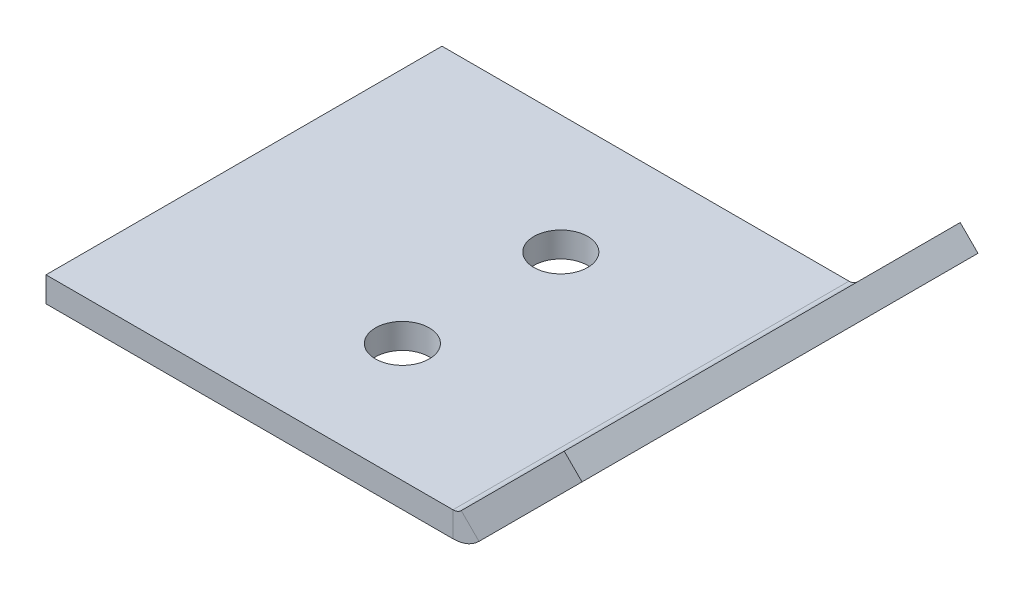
ISO-10303-21;
HEADER;
FILE_DESCRIPTION(('STEP AP214'),'2;1');
FILE_NAME('part.step','',(''),(''),'','','');
FILE_SCHEMA(('AUTOMOTIVE_DESIGN { 1 0 10303 214 1 1 1 1 }'));
ENDSEC;
DATA;
#1=APPLICATION_CONTEXT('core data for automotive mechanical design processes');
#2=APPLICATION_PROTOCOL_DEFINITION('international standard','automotive_design',2000,#1);
#3=PRODUCT_CONTEXT('',#1,'mechanical');
#4=PRODUCT('Part','Part','',(#3));
#5=PRODUCT_RELATED_PRODUCT_CATEGORY('part','',(#4));
#6=PRODUCT_DEFINITION_FORMATION('','',#4);
#7=PRODUCT_DEFINITION_CONTEXT('part definition',#1,'design');
#8=PRODUCT_DEFINITION('design','',#6,#7);
#9=PRODUCT_DEFINITION_SHAPE('','',#8);
#10=(LENGTH_UNIT() NAMED_UNIT(*) SI_UNIT(.MILLI.,.METRE.));
#11=(NAMED_UNIT(*) PLANE_ANGLE_UNIT() SI_UNIT($,.RADIAN.));
#12=(NAMED_UNIT(*) SI_UNIT($,.STERADIAN.) SOLID_ANGLE_UNIT());
#13=UNCERTAINTY_MEASURE_WITH_UNIT(LENGTH_MEASURE(1.E-05),#10,'distance_accuracy_value','');
#14=(GEOMETRIC_REPRESENTATION_CONTEXT(3) GLOBAL_UNCERTAINTY_ASSIGNED_CONTEXT((#13)) GLOBAL_UNIT_ASSIGNED_CONTEXT((#10,
#11,#12)) REPRESENTATION_CONTEXT('',''));
#15=CARTESIAN_POINT('',(0.,0.,0.));
#16=DIRECTION('',(0.,0.,1.));
#17=DIRECTION('',(1.,0.,0.));
#18=AXIS2_PLACEMENT_3D('',#15,#16,#17);
#19=CARTESIAN_POINT('',(0.,1.5875,12.5));
#20=DIRECTION('',(0.,0.,-1.));
#21=DIRECTION('',(-1.,0.,0.));
#22=AXIS2_PLACEMENT_3D('',#19,#20,#21);
#23=PLANE('',#22);
#24=DIRECTION('',(0.,-1.,0.));
#25=VECTOR('',#24,1.);
#26=CARTESIAN_POINT('',(25.694890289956,1.58749999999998,12.5));
#27=LINE('',#26,#25);
#28=CARTESIAN_POINT('',(25.694890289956,1.58749999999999,12.5));
#29=VERTEX_POINT('',#28);
#30=CARTESIAN_POINT('',(25.694890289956,0.,12.5));
#31=VERTEX_POINT('',#30);
#32=EDGE_CURVE('E69',#29,#31,#27,.T.);
#33=ORIENTED_EDGE('',*,*,#32,.F.);
#34=DIRECTION('',(1.,0.,0.));
#35=VECTOR('',#34,1.);
#36=CARTESIAN_POINT('',(0.,1.5875,12.5));
#37=LINE('',#36,#35);
#38=CARTESIAN_POINT('',(0.,1.5875,12.5));
#39=VERTEX_POINT('',#38);
#40=EDGE_CURVE('E187',#39,#29,#37,.T.);
#41=ORIENTED_EDGE('',*,*,#40,.F.);
#42=DIRECTION('',(0.,-1.,0.));
#43=VECTOR('',#42,1.);
#44=CARTESIAN_POINT('',(0.,1.5875,12.5));
#45=LINE('',#44,#43);
#46=CARTESIAN_POINT('',(0.,0.,12.5));
#47=VERTEX_POINT('',#46);
#48=EDGE_CURVE('E11',#39,#47,#45,.T.);
#49=ORIENTED_EDGE('',*,*,#48,.T.);
#50=DIRECTION('',(1.,0.,0.));
#51=VECTOR('',#50,1.);
#52=CARTESIAN_POINT('',(0.,0.,12.5));
#53=LINE('',#52,#51);
#54=EDGE_CURVE('E197',#47,#31,#53,.T.);
#55=ORIENTED_EDGE('',*,*,#54,.T.);
#56=EDGE_LOOP('',(#33,#41,#49,#55));
#57=FACE_BOUND('',#56,.T.);
#58=ADVANCED_FACE('F45',(#57),#23,.F.);
#59=CARTESIAN_POINT('',(0.,1.58749999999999,-12.5));
#60=DIRECTION('',(0.,0.,1.));
#61=DIRECTION('',(1.,0.,0.));
#62=AXIS2_PLACEMENT_3D('',#59,#60,#61);
#63=PLANE('',#62);
#64=DIRECTION('',(0.,-1.,0.));
#65=VECTOR('',#64,1.);
#66=CARTESIAN_POINT('',(25.694890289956,1.58749999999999,-12.5));
#67=LINE('',#66,#65);
#68=CARTESIAN_POINT('',(25.694890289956,1.5875,-12.5));
#69=VERTEX_POINT('',#68);
#70=CARTESIAN_POINT('',(25.694890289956,0.,-12.5));
#71=VERTEX_POINT('',#70);
#72=EDGE_CURVE('E171',#69,#71,#67,.T.);
#73=ORIENTED_EDGE('',*,*,#72,.T.);
#74=DIRECTION('',(-1.,0.,0.));
#75=VECTOR('',#74,1.);
#76=CARTESIAN_POINT('',(0.,0.,-12.5));
#77=LINE('',#76,#75);
#78=CARTESIAN_POINT('',(0.,0.,-12.5));
#79=VERTEX_POINT('',#78);
#80=EDGE_CURVE('E188',#71,#79,#77,.T.);
#81=ORIENTED_EDGE('',*,*,#80,.T.);
#82=DIRECTION('',(0.,-1.,0.));
#83=VECTOR('',#82,1.);
#84=CARTESIAN_POINT('',(0.,1.58749999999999,-12.5));
#85=LINE('',#84,#83);
#86=CARTESIAN_POINT('',(0.,1.58749999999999,-12.5));
#87=VERTEX_POINT('',#86);
#88=EDGE_CURVE('E54',#87,#79,#85,.T.);
#89=ORIENTED_EDGE('',*,*,#88,.F.);
#90=DIRECTION('',(-1.,0.,0.));
#91=VECTOR('',#90,1.);
#92=CARTESIAN_POINT('',(0.,1.58749999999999,-12.5));
#93=LINE('',#92,#91);
#94=EDGE_CURVE('E191',#69,#87,#93,.T.);
#95=ORIENTED_EDGE('',*,*,#94,.F.);
#96=EDGE_LOOP('',(#73,#81,#89,#95));
#97=FACE_BOUND('',#96,.T.);
#98=ADVANCED_FACE('F215',(#97),#63,.F.);
#99=CARTESIAN_POINT('',(0.,1.5875,12.5));
#100=DIRECTION('',(0.,1.,0.));
#101=DIRECTION('',(0.,0.,1.));
#102=AXIS2_PLACEMENT_3D('',#99,#100,#101);
#103=PLANE('',#102);
#104=CARTESIAN_POINT('',(15.,1.5875,5.00000000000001));
#105=DIRECTION('',(0.,1.,0.));
#106=DIRECTION('',(0.,0.,1.));
#107=AXIS2_PLACEMENT_3D('',#104,#105,#106);
#108=CIRCLE('',#107,1.69999999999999);
#109=CARTESIAN_POINT('',(15.,1.5875,6.7));
#110=VERTEX_POINT('',#109);
#111=EDGE_CURVE('E326',#110,#110,#108,.T.);
#112=ORIENTED_EDGE('',*,*,#111,.F.);
#113=EDGE_LOOP('',(#112));
#114=FACE_BOUND('',#113,.T.);
#115=CARTESIAN_POINT('',(15.,1.5875,-5.));
#116=DIRECTION('',(0.,1.,0.));
#117=DIRECTION('',(0.,0.,1.));
#118=AXIS2_PLACEMENT_3D('',#115,#116,#117);
#119=CIRCLE('',#118,1.69999999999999);
#120=CARTESIAN_POINT('',(15.,1.5875,-3.30000000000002));
#121=VERTEX_POINT('',#120);
#122=EDGE_CURVE('E229',#121,#121,#119,.T.);
#123=ORIENTED_EDGE('',*,*,#122,.F.);
#124=EDGE_LOOP('',(#123));
#125=FACE_BOUND('',#124,.T.);
#126=ORIENTED_EDGE('',*,*,#40,.T.);
#127=DIRECTION('',(0.,0.,-1.));
#128=VECTOR('',#127,1.);
#129=CARTESIAN_POINT('',(25.694890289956,1.58749999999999,-12.5));
#130=LINE('',#129,#128);
#131=EDGE_CURVE('E61',#69,#29,#130,.F.);
#132=ORIENTED_EDGE('',*,*,#131,.F.);
#133=ORIENTED_EDGE('',*,*,#94,.T.);
#134=DIRECTION('',(0.,0.,1.));
#135=VECTOR('',#134,1.);
#136=CARTESIAN_POINT('',(0.,1.58749999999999,-12.5));
#137=LINE('',#136,#135);
#138=EDGE_CURVE('E183',#87,#39,#137,.T.);
#139=ORIENTED_EDGE('',*,*,#138,.T.);
#140=EDGE_LOOP('',(#126,#132,#133,#139));
#141=FACE_BOUND('',#140,.T.);
#142=ADVANCED_FACE('F213',(#114,#125,#141),#103,.T.);
#143=CARTESIAN_POINT('',(0.,0.,12.5));
#144=DIRECTION('',(0.,1.,0.));
#145=DIRECTION('',(0.,0.,1.));
#146=AXIS2_PLACEMENT_3D('',#143,#144,#145);
#147=PLANE('',#146);
#148=CARTESIAN_POINT('',(15.,0.,5.00000000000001));
#149=DIRECTION('',(0.,-1.,0.));
#150=DIRECTION('',(0.,0.,-1.));
#151=AXIS2_PLACEMENT_3D('',#148,#149,#150);
#152=CIRCLE('',#151,1.69999999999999);
#153=CARTESIAN_POINT('',(15.,0.,3.30000000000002));
#154=VERTEX_POINT('',#153);
#155=EDGE_CURVE('E329',#154,#154,#152,.T.);
#156=ORIENTED_EDGE('',*,*,#155,.F.);
#157=EDGE_LOOP('',(#156));
#158=FACE_BOUND('',#157,.T.);
#159=CARTESIAN_POINT('',(15.,0.,-4.99999999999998));
#160=DIRECTION('',(0.,-1.,0.));
#161=DIRECTION('',(0.,0.,-1.));
#162=AXIS2_PLACEMENT_3D('',#159,#160,#161);
#163=CIRCLE('',#162,1.69999999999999);
#164=CARTESIAN_POINT('',(15.,0.,-6.69999999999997));
#165=VERTEX_POINT('',#164);
#166=EDGE_CURVE('E333',#165,#165,#163,.T.);
#167=ORIENTED_EDGE('',*,*,#166,.F.);
#168=EDGE_LOOP('',(#167));
#169=FACE_BOUND('',#168,.T.);
#170=DIRECTION('',(0.,0.,-1.));
#171=VECTOR('',#170,1.);
#172=CARTESIAN_POINT('',(25.694890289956,0.,-12.5));
#173=LINE('',#172,#171);
#174=EDGE_CURVE('E165',#71,#31,#173,.F.);
#175=ORIENTED_EDGE('',*,*,#174,.T.);
#176=ORIENTED_EDGE('',*,*,#54,.F.);
#177=DIRECTION('',(0.,0.,1.));
#178=VECTOR('',#177,1.);
#179=CARTESIAN_POINT('',(0.,0.,-12.5));
#180=LINE('',#179,#178);
#181=EDGE_CURVE('E181',#79,#47,#180,.T.);
#182=ORIENTED_EDGE('',*,*,#181,.F.);
#183=ORIENTED_EDGE('',*,*,#80,.F.);
#184=EDGE_LOOP('',(#175,#176,#182,#183));
#185=FACE_BOUND('',#184,.T.);
#186=ADVANCED_FACE('F211',(#158,#169,#185),#147,.F.);
#187=CARTESIAN_POINT('',(0.,1.58749999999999,-12.5));
#188=DIRECTION('',(1.,0.,0.));
#189=DIRECTION('',(0.,0.,-1.));
#190=AXIS2_PLACEMENT_3D('',#187,#188,#189);
#191=PLANE('',#190);
#192=ORIENTED_EDGE('',*,*,#181,.T.);
#193=ORIENTED_EDGE('',*,*,#48,.F.);
#194=ORIENTED_EDGE('',*,*,#138,.F.);
#195=ORIENTED_EDGE('',*,*,#88,.T.);
#196=EDGE_LOOP('',(#192,#193,#194,#195));
#197=FACE_BOUND('',#196,.T.);
#198=ADVANCED_FACE('F47',(#197),#191,.F.);
#199=CARTESIAN_POINT('',(25.694890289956,2.3241,12.5));
#200=DIRECTION('',(0.,0.,1.));
#201=DIRECTION('',(1.,0.,0.));
#202=AXIS2_PLACEMENT_3D('',#199,#200,#201);
#203=PLANE('',#202);
#204=DIRECTION('',(0.707106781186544,-0.707106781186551,0.));
#205=VECTOR('',#204,1.);
#206=CARTESIAN_POINT('',(26.215745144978,1.80324514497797,12.5));
#207=LINE('',#206,#205);
#208=CARTESIAN_POINT('',(26.215745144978,1.80324514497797,12.5));
#209=VERTEX_POINT('',#208);
#210=CARTESIAN_POINT('',(27.3382771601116,0.680713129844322,12.5));
#211=VERTEX_POINT('',#210);
#212=EDGE_CURVE('E127',#209,#211,#207,.T.);
#213=ORIENTED_EDGE('',*,*,#212,.F.);
#214=CARTESIAN_POINT('',(25.694890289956,2.3241,12.5));
#215=DIRECTION('',(0.,0.,-1.));
#216=DIRECTION('',(-1.,0.,0.));
#217=AXIS2_PLACEMENT_3D('',#214,#215,#216);
#218=CIRCLE('',#217,0.73660000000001);
#219=EDGE_CURVE('E174',#29,#209,#218,.F.);
#220=ORIENTED_EDGE('',*,*,#219,.F.);
#221=ORIENTED_EDGE('',*,*,#32,.T.);
#222=CARTESIAN_POINT('',(25.694890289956,2.3241,12.5));
#223=DIRECTION('',(0.,0.,-1.));
#224=DIRECTION('',(-1.,0.,0.));
#225=AXIS2_PLACEMENT_3D('',#222,#223,#224);
#226=CIRCLE('',#225,2.32410000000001);
#227=EDGE_CURVE('E167',#31,#211,#226,.F.);
#228=ORIENTED_EDGE('',*,*,#227,.T.);
#229=EDGE_LOOP('',(#213,#220,#221,#228));
#230=FACE_BOUND('',#229,.T.);
#231=ADVANCED_FACE('F265',(#230),#203,.T.);
#232=CARTESIAN_POINT('',(25.694890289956,2.32409999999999,-12.5));
#233=DIRECTION('',(0.,0.,1.));
#234=DIRECTION('',(1.,0.,0.));
#235=AXIS2_PLACEMENT_3D('',#232,#233,#234);
#236=PLANE('',#235);
#237=CARTESIAN_POINT('',(25.694890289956,2.32409999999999,-12.5));
#238=DIRECTION('',(0.,0.,-1.));
#239=DIRECTION('',(-1.,0.,0.));
#240=AXIS2_PLACEMENT_3D('',#237,#238,#239);
#241=CIRCLE('',#240,0.73660000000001);
#242=CARTESIAN_POINT('',(26.215745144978,1.80324514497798,-12.5));
#243=VERTEX_POINT('',#242);
#244=EDGE_CURVE('E163',#243,#69,#241,.T.);
#245=ORIENTED_EDGE('',*,*,#244,.F.);
#246=DIRECTION('',(0.707106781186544,-0.707106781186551,0.));
#247=VECTOR('',#246,1.);
#248=CARTESIAN_POINT('',(26.215745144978,1.80324514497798,-12.5));
#249=LINE('',#248,#247);
#250=CARTESIAN_POINT('',(27.3382771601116,0.680713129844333,-12.5));
#251=VERTEX_POINT('',#250);
#252=EDGE_CURVE('E226',#243,#251,#249,.T.);
#253=ORIENTED_EDGE('',*,*,#252,.T.);
#254=CARTESIAN_POINT('',(25.694890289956,2.32409999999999,-12.5));
#255=DIRECTION('',(0.,0.,-1.));
#256=DIRECTION('',(-1.,0.,0.));
#257=AXIS2_PLACEMENT_3D('',#254,#255,#256);
#258=CIRCLE('',#257,2.32410000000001);
#259=EDGE_CURVE('E168',#251,#71,#258,.T.);
#260=ORIENTED_EDGE('',*,*,#259,.T.);
#261=ORIENTED_EDGE('',*,*,#72,.F.);
#262=EDGE_LOOP('',(#245,#253,#260,#261));
#263=FACE_BOUND('',#262,.T.);
#264=ADVANCED_FACE('F218',(#263),#236,.F.);
#265=CARTESIAN_POINT('',(25.694890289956,2.32409999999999,-12.5));
#266=DIRECTION('',(0.,0.,-1.));
#267=DIRECTION('',(0.707106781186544,-0.707106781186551,0.));
#268=AXIS2_PLACEMENT_3D('',#265,#266,#267);
#269=CYLINDRICAL_SURFACE('',#268,2.32410000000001);
#270=ORIENTED_EDGE('',*,*,#174,.F.);
#271=ORIENTED_EDGE('',*,*,#259,.F.);
#272=DIRECTION('',(0.,0.,-1.));
#273=VECTOR('',#272,1.);
#274=CARTESIAN_POINT('',(27.3382771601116,0.680713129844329,-12.5));
#275=LINE('',#274,#273);
#276=EDGE_CURVE('E157',#211,#251,#275,.T.);
#277=ORIENTED_EDGE('',*,*,#276,.F.);
#278=ORIENTED_EDGE('',*,*,#227,.F.);
#279=EDGE_LOOP('',(#270,#271,#277,#278));
#280=FACE_BOUND('',#279,.T.);
#281=ADVANCED_FACE('F264',(#280),#269,.T.);
#282=CARTESIAN_POINT('',(25.694890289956,2.32409999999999,-12.5));
#283=DIRECTION('',(0.,0.,-1.));
#284=DIRECTION('',(0.707106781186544,-0.707106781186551,0.));
#285=AXIS2_PLACEMENT_3D('',#282,#283,#284);
#286=CYLINDRICAL_SURFACE('',#285,0.73660000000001);
#287=ORIENTED_EDGE('',*,*,#131,.T.);
#288=ORIENTED_EDGE('',*,*,#219,.T.);
#289=DIRECTION('',(0.,0.,-1.));
#290=VECTOR('',#289,1.);
#291=CARTESIAN_POINT('',(26.215745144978,1.80324514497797,12.5));
#292=LINE('',#291,#290);
#293=EDGE_CURVE('E224',#209,#243,#292,.T.);
#294=ORIENTED_EDGE('',*,*,#293,.T.);
#295=ORIENTED_EDGE('',*,*,#244,.T.);
#296=EDGE_LOOP('',(#287,#288,#294,#295));
#297=FACE_BOUND('',#296,.T.);
#298=ADVANCED_FACE('F221',(#297),#286,.F.);
#299=CARTESIAN_POINT('',(27.1225320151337,0.464967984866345,-12.5));
#300=DIRECTION('',(0.,0.,-1.));
#301=DIRECTION('',(-1.,0.,0.));
#302=AXIS2_PLACEMENT_3D('',#299,#300,#301);
#303=PLANE('',#302);
#304=DIRECTION('',(-0.707106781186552,-0.707106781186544,0.));
#305=VECTOR('',#304,1.);
#306=CARTESIAN_POINT('',(27.1225320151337,0.464967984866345,-12.5));
#307=LINE('',#306,#305);
#308=CARTESIAN_POINT('',(33.8400464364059,7.18248240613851,-12.5));
#309=VERTEX_POINT('',#308);
#310=EDGE_CURVE('E143',#309,#251,#307,.T.);
#311=ORIENTED_EDGE('',*,*,#310,.T.);
#312=ORIENTED_EDGE('',*,*,#252,.F.);
#313=DIRECTION('',(-0.707106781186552,-0.707106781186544,0.));
#314=VECTOR('',#313,1.);
#315=CARTESIAN_POINT('',(26.,1.5875,-12.5));
#316=LINE('',#315,#314);
#317=CARTESIAN_POINT('',(32.7175144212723,8.30501442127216,-12.5));
#318=VERTEX_POINT('',#317);
#319=EDGE_CURVE('E133',#318,#243,#316,.T.);
#320=ORIENTED_EDGE('',*,*,#319,.F.);
#321=DIRECTION('',(-0.707106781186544,0.707106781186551,0.));
#322=VECTOR('',#321,1.);
#323=CARTESIAN_POINT('',(33.8400464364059,7.18248240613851,-12.5));
#324=LINE('',#323,#322);
#325=EDGE_CURVE('E142',#309,#318,#324,.T.);
#326=ORIENTED_EDGE('',*,*,#325,.F.);
#327=EDGE_LOOP('',(#311,#312,#320,#326));
#328=FACE_BOUND('',#327,.T.);
#329=ADVANCED_FACE('F237',(#328),#303,.T.);
#330=CARTESIAN_POINT('',(33.8400464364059,7.18248240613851,12.5));
#331=DIRECTION('',(0.,0.,1.));
#332=DIRECTION('',(1.,0.,0.));
#333=AXIS2_PLACEMENT_3D('',#330,#331,#332);
#334=PLANE('',#333);
#335=DIRECTION('',(0.707106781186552,0.707106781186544,0.));
#336=VECTOR('',#335,1.);
#337=CARTESIAN_POINT('',(32.7175144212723,8.30501442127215,12.5));
#338=LINE('',#337,#336);
#339=CARTESIAN_POINT('',(32.7175144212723,8.30501442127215,12.5));
#340=VERTEX_POINT('',#339);
#341=EDGE_CURVE('E154',#209,#340,#338,.T.);
#342=ORIENTED_EDGE('',*,*,#341,.F.);
#343=ORIENTED_EDGE('',*,*,#212,.T.);
#344=DIRECTION('',(0.707106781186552,0.707106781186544,0.));
#345=VECTOR('',#344,1.);
#346=CARTESIAN_POINT('',(33.8400464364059,7.18248240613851,12.5));
#347=LINE('',#346,#345);
#348=CARTESIAN_POINT('',(33.8400464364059,7.18248240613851,12.5));
#349=VERTEX_POINT('',#348);
#350=EDGE_CURVE('E121',#211,#349,#347,.T.);
#351=ORIENTED_EDGE('',*,*,#350,.T.);
#352=DIRECTION('',(-0.707106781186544,0.707106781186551,0.));
#353=VECTOR('',#352,1.);
#354=CARTESIAN_POINT('',(33.8400464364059,7.18248240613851,12.5));
#355=LINE('',#354,#353);
#356=EDGE_CURVE('E125',#349,#340,#355,.T.);
#357=ORIENTED_EDGE('',*,*,#356,.T.);
#358=EDGE_LOOP('',(#342,#343,#351,#357));
#359=FACE_BOUND('',#358,.T.);
#360=ADVANCED_FACE('F124',(#359),#334,.T.);
#361=CARTESIAN_POINT('',(27.1225320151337,0.464967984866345,-12.5));
#362=DIRECTION('',(0.707106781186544,-0.707106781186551,0.));
#363=DIRECTION('',(0.707106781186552,0.707106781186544,0.));
#364=AXIS2_PLACEMENT_3D('',#361,#362,#363);
#365=PLANE('',#364);
#366=ORIENTED_EDGE('',*,*,#350,.F.);
#367=ORIENTED_EDGE('',*,*,#276,.T.);
#368=ORIENTED_EDGE('',*,*,#310,.F.);
#369=DIRECTION('',(0.,0.,-1.));
#370=VECTOR('',#369,1.);
#371=CARTESIAN_POINT('',(33.8400464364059,7.18248240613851,-12.5));
#372=LINE('',#371,#370);
#373=EDGE_CURVE('E132',#349,#309,#372,.T.);
#374=ORIENTED_EDGE('',*,*,#373,.F.);
#375=EDGE_LOOP('',(#366,#367,#368,#374));
#376=FACE_BOUND('',#375,.T.);
#377=ADVANCED_FACE('F145',(#376),#365,.T.);
#378=CARTESIAN_POINT('',(26.,1.5875,-12.5));
#379=DIRECTION('',(0.707106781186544,-0.707106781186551,0.));
#380=DIRECTION('',(0.707106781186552,0.707106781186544,0.));
#381=AXIS2_PLACEMENT_3D('',#378,#379,#380);
#382=PLANE('',#381);
#383=ORIENTED_EDGE('',*,*,#293,.F.);
#384=ORIENTED_EDGE('',*,*,#341,.T.);
#385=DIRECTION('',(0.,0.,-1.));
#386=VECTOR('',#385,1.);
#387=CARTESIAN_POINT('',(32.7175144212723,8.30501442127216,-12.5));
#388=LINE('',#387,#386);
#389=EDGE_CURVE('E140',#340,#318,#388,.T.);
#390=ORIENTED_EDGE('',*,*,#389,.T.);
#391=ORIENTED_EDGE('',*,*,#319,.T.);
#392=EDGE_LOOP('',(#383,#384,#390,#391));
#393=FACE_BOUND('',#392,.T.);
#394=ADVANCED_FACE('F239',(#393),#382,.F.);
#395=CARTESIAN_POINT('',(33.8400464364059,7.18248240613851,-12.5));
#396=DIRECTION('',(0.707106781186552,0.707106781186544,0.));
#397=DIRECTION('',(-0.707106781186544,0.707106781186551,0.));
#398=AXIS2_PLACEMENT_3D('',#395,#396,#397);
#399=PLANE('',#398);
#400=ORIENTED_EDGE('',*,*,#389,.F.);
#401=ORIENTED_EDGE('',*,*,#356,.F.);
#402=ORIENTED_EDGE('',*,*,#373,.T.);
#403=ORIENTED_EDGE('',*,*,#325,.T.);
#404=EDGE_LOOP('',(#400,#401,#402,#403));
#405=FACE_BOUND('',#404,.T.);
#406=ADVANCED_FACE('F137',(#405),#399,.T.);
#407=CARTESIAN_POINT('',(15.,0.,-4.99999999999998));
#408=DIRECTION('',(0.,-1.,0.));
#409=DIRECTION('',(0.,0.,-1.));
#410=AXIS2_PLACEMENT_3D('',#407,#408,#409);
#411=CYLINDRICAL_SURFACE('',#410,1.69999999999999);
#412=ORIENTED_EDGE('',*,*,#122,.T.);
#413=EDGE_LOOP('',(#412));
#414=FACE_BOUND('',#413,.T.);
#415=ORIENTED_EDGE('',*,*,#166,.T.);
#416=EDGE_LOOP('',(#415));
#417=FACE_BOUND('',#416,.T.);
#418=ADVANCED_FACE('F246',(#414,#417),#411,.F.);
#419=CARTESIAN_POINT('',(15.,0.,5.00000000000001));
#420=DIRECTION('',(0.,-1.,0.));
#421=DIRECTION('',(0.,0.,-1.));
#422=AXIS2_PLACEMENT_3D('',#419,#420,#421);
#423=CYLINDRICAL_SURFACE('',#422,1.69999999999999);
#424=ORIENTED_EDGE('',*,*,#111,.T.);
#425=EDGE_LOOP('',(#424));
#426=FACE_BOUND('',#425,.T.);
#427=ORIENTED_EDGE('',*,*,#155,.T.);
#428=EDGE_LOOP('',(#427));
#429=FACE_BOUND('',#428,.T.);
#430=ADVANCED_FACE('F309',(#426,#429),#423,.F.);
#431=CLOSED_SHELL('',(#58,#98,#142,#186,#198,#231,#264,#281,#298,#329,#360,#377,#394,#406,#418,#430));
#432=MANIFOLD_SOLID_BREP('B2',#431);
#433=ADVANCED_BREP_SHAPE_REPRESENTATION('',(#18,#432),#14);
#434=SHAPE_DEFINITION_REPRESENTATION(#9,#433);
ENDSEC;
END-ISO-10303-21;
